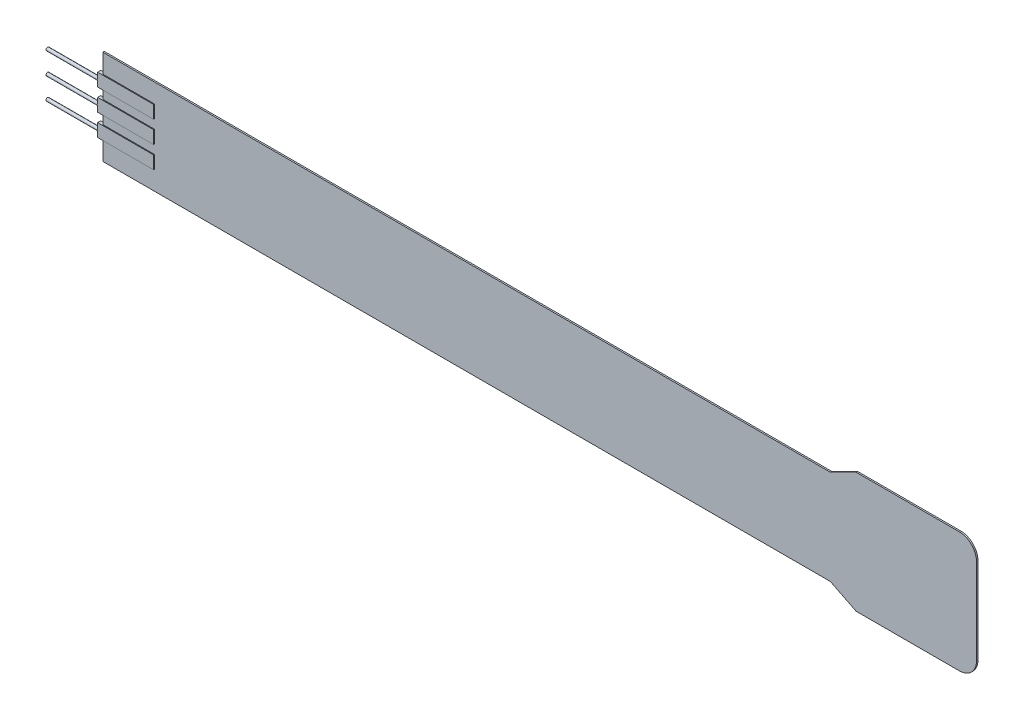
ISO-10303-21;
HEADER;
FILE_DESCRIPTION(('STEP AP214'),'2;1');
FILE_NAME('part.step','',(''),(''),'','','');
FILE_SCHEMA(('AUTOMOTIVE_DESIGN { 1 0 10303 214 1 1 1 1 }'));
ENDSEC;
DATA;
#1=APPLICATION_CONTEXT('core data for automotive mechanical design processes');
#2=APPLICATION_PROTOCOL_DEFINITION('international standard','automotive_design',2000,#1);
#3=PRODUCT_CONTEXT('',#1,'mechanical');
#4=PRODUCT('Part','Part','',(#3));
#5=PRODUCT_RELATED_PRODUCT_CATEGORY('part','',(#4));
#6=PRODUCT_DEFINITION_FORMATION('','',#4);
#7=PRODUCT_DEFINITION_CONTEXT('part definition',#1,'design');
#8=PRODUCT_DEFINITION('design','',#6,#7);
#9=PRODUCT_DEFINITION_SHAPE('','',#8);
#10=(LENGTH_UNIT() NAMED_UNIT(*) SI_UNIT(.MILLI.,.METRE.));
#11=(NAMED_UNIT(*) PLANE_ANGLE_UNIT() SI_UNIT($,.RADIAN.));
#12=(NAMED_UNIT(*) SI_UNIT($,.STERADIAN.) SOLID_ANGLE_UNIT());
#13=UNCERTAINTY_MEASURE_WITH_UNIT(LENGTH_MEASURE(1.E-05),#10,'distance_accuracy_value','');
#14=(GEOMETRIC_REPRESENTATION_CONTEXT(3) GLOBAL_UNCERTAINTY_ASSIGNED_CONTEXT((#13)) GLOBAL_UNIT_ASSIGNED_CONTEXT((#10,
#11,#12)) REPRESENTATION_CONTEXT('',''));
#15=CARTESIAN_POINT('',(0.,0.,0.));
#16=DIRECTION('',(0.,0.,1.));
#17=DIRECTION('',(1.,0.,0.));
#18=AXIS2_PLACEMENT_3D('',#15,#16,#17);
#19=CARTESIAN_POINT('',(7.,13.9999999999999,0.27));
#20=DIRECTION('',(0.,0.,-1.));
#21=DIRECTION('',(-1.,0.,0.));
#22=AXIS2_PLACEMENT_3D('',#19,#20,#21);
#23=PLANE('',#22);
#24=DIRECTION('',(1.,0.,0.));
#25=VECTOR('',#24,1.);
#26=CARTESIAN_POINT('',(-88.6,3.29,0.27));
#27=LINE('',#26,#25);
#28=CARTESIAN_POINT('',(-88.6,3.29,0.27));
#29=VERTEX_POINT('',#28);
#30=CARTESIAN_POINT('',(-95.1,3.29,0.27));
#31=VERTEX_POINT('',#30);
#32=EDGE_CURVE('P0_E79',#29,#31,#27,.F.);
#33=ORIENTED_EDGE('',*,*,#32,.T.);
#34=DIRECTION('',(0.,1.,0.));
#35=VECTOR('',#34,1.);
#36=CARTESIAN_POINT('',(-95.1,3.29,0.27));
#37=LINE('',#36,#35);
#38=CARTESIAN_POINT('',(-95.1,1.79,0.27));
#39=VERTEX_POINT('',#38);
#40=EDGE_CURVE('P0_E54',#31,#39,#37,.F.);
#41=ORIENTED_EDGE('',*,*,#40,.T.);
#42=DIRECTION('',(1.,0.,0.));
#43=VECTOR('',#42,1.);
#44=CARTESIAN_POINT('',(-88.6,1.79,0.27));
#45=LINE('',#44,#43);
#46=CARTESIAN_POINT('',(-88.6,1.79,0.27));
#47=VERTEX_POINT('',#46);
#48=EDGE_CURVE('P0_E56',#39,#47,#45,.T.);
#49=ORIENTED_EDGE('',*,*,#48,.T.);
#50=DIRECTION('',(0.,1.,0.));
#51=VECTOR('',#50,1.);
#52=CARTESIAN_POINT('',(-88.6,3.29,0.27));
#53=LINE('',#52,#51);
#54=EDGE_CURVE('P0_E19',#47,#29,#53,.T.);
#55=ORIENTED_EDGE('',*,*,#54,.T.);
#56=EDGE_LOOP('',(#33,#41,#49,#55));
#57=FACE_BOUND('',#56,.T.);
#58=ADVANCED_FACE('P0_F16',(#57),#23,.F.);
#59=CARTESIAN_POINT('',(-88.6,3.29,-0.1));
#60=DIRECTION('',(-1.,0.,0.));
#61=DIRECTION('',(0.,0.,1.));
#62=AXIS2_PLACEMENT_3D('',#59,#60,#61);
#63=PLANE('',#62);
#64=ORIENTED_EDGE('',*,*,#54,.F.);
#65=DIRECTION('',(0.,0.,1.));
#66=VECTOR('',#65,1.);
#67=CARTESIAN_POINT('',(-88.6,1.79,-0.1));
#68=LINE('',#67,#66);
#69=CARTESIAN_POINT('',(-88.6,1.79,-0.1));
#70=VERTEX_POINT('',#69);
#71=EDGE_CURVE('P0_E62',#47,#70,#68,.F.);
#72=ORIENTED_EDGE('',*,*,#71,.T.);
#73=DIRECTION('',(0.,1.,0.));
#74=VECTOR('',#73,1.);
#75=CARTESIAN_POINT('',(-88.6,1.79,-0.1));
#76=LINE('',#75,#74);
#77=CARTESIAN_POINT('',(-88.6,3.29,-0.1));
#78=VERTEX_POINT('',#77);
#79=EDGE_CURVE('P0_E82',#78,#70,#76,.F.);
#80=ORIENTED_EDGE('',*,*,#79,.F.);
#81=DIRECTION('',(0.,0.,-1.));
#82=VECTOR('',#81,1.);
#83=CARTESIAN_POINT('',(-88.6,3.29,-0.1));
#84=LINE('',#83,#82);
#85=EDGE_CURVE('P0_E67',#78,#29,#84,.F.);
#86=ORIENTED_EDGE('',*,*,#85,.T.);
#87=EDGE_LOOP('',(#64,#72,#80,#86));
#88=FACE_BOUND('',#87,.T.);
#89=ADVANCED_FACE('P0_F64',(#88),#63,.F.);
#90=CARTESIAN_POINT('',(-88.6,1.79,-0.1));
#91=DIRECTION('',(0.,1.,0.));
#92=DIRECTION('',(0.,0.,1.));
#93=AXIS2_PLACEMENT_3D('',#90,#91,#92);
#94=PLANE('',#93);
#95=ORIENTED_EDGE('',*,*,#48,.F.);
#96=DIRECTION('',(0.,0.,-1.));
#97=VECTOR('',#96,1.);
#98=CARTESIAN_POINT('',(-95.1,1.79,-0.1));
#99=LINE('',#98,#97);
#100=CARTESIAN_POINT('',(-95.1,1.79,-0.1));
#101=VERTEX_POINT('',#100);
#102=EDGE_CURVE('P0_E74',#39,#101,#99,.T.);
#103=ORIENTED_EDGE('',*,*,#102,.T.);
#104=DIRECTION('',(-1.,0.,0.));
#105=VECTOR('',#104,1.);
#106=CARTESIAN_POINT('',(-88.6,1.79,-0.1));
#107=LINE('',#106,#105);
#108=EDGE_CURVE('P0_E71',#70,#101,#107,.T.);
#109=ORIENTED_EDGE('',*,*,#108,.F.);
#110=ORIENTED_EDGE('',*,*,#71,.F.);
#111=EDGE_LOOP('',(#95,#103,#109,#110));
#112=FACE_BOUND('',#111,.T.);
#113=ADVANCED_FACE('P0_F69',(#112),#94,.F.);
#114=CARTESIAN_POINT('',(-95.1,3.29,-0.1));
#115=DIRECTION('',(1.,0.,0.));
#116=DIRECTION('',(0.,0.,-1.));
#117=AXIS2_PLACEMENT_3D('',#114,#115,#116);
#118=PLANE('',#117);
#119=ORIENTED_EDGE('',*,*,#40,.F.);
#120=DIRECTION('',(0.,0.,-1.));
#121=VECTOR('',#120,1.);
#122=CARTESIAN_POINT('',(-95.1,3.29,-0.1));
#123=LINE('',#122,#121);
#124=CARTESIAN_POINT('',(-95.1,3.29,-0.1));
#125=VERTEX_POINT('',#124);
#126=EDGE_CURVE('P0_E34',#31,#125,#123,.T.);
#127=ORIENTED_EDGE('',*,*,#126,.T.);
#128=DIRECTION('',(0.,1.,0.));
#129=VECTOR('',#128,1.);
#130=CARTESIAN_POINT('',(-95.1,1.79,-0.1));
#131=LINE('',#130,#129);
#132=EDGE_CURVE('P0_E25',#101,#125,#131,.T.);
#133=ORIENTED_EDGE('',*,*,#132,.F.);
#134=ORIENTED_EDGE('',*,*,#102,.F.);
#135=EDGE_LOOP('',(#119,#127,#133,#134));
#136=FACE_BOUND('',#135,.T.);
#137=ADVANCED_FACE('P0_F88',(#136),#118,.F.);
#138=CARTESIAN_POINT('',(-88.6,3.29,-0.1));
#139=DIRECTION('',(0.,-1.,0.));
#140=DIRECTION('',(0.,0.,-1.));
#141=AXIS2_PLACEMENT_3D('',#138,#139,#140);
#142=PLANE('',#141);
#143=ORIENTED_EDGE('',*,*,#32,.F.);
#144=ORIENTED_EDGE('',*,*,#85,.F.);
#145=DIRECTION('',(-1.,0.,0.));
#146=VECTOR('',#145,1.);
#147=CARTESIAN_POINT('',(-88.6,3.29,-0.1));
#148=LINE('',#147,#146);
#149=EDGE_CURVE('P0_E11',#125,#78,#148,.F.);
#150=ORIENTED_EDGE('',*,*,#149,.F.);
#151=ORIENTED_EDGE('',*,*,#126,.F.);
#152=EDGE_LOOP('',(#143,#144,#150,#151));
#153=FACE_BOUND('',#152,.T.);
#154=ADVANCED_FACE('P0_F90',(#153),#142,.F.);
#155=CARTESIAN_POINT('',(-88.6,1.79,-0.1));
#156=DIRECTION('',(0.,0.,-1.));
#157=DIRECTION('',(-1.,0.,0.));
#158=AXIS2_PLACEMENT_3D('',#155,#156,#157);
#159=PLANE('',#158);
#160=ORIENTED_EDGE('',*,*,#132,.T.);
#161=ORIENTED_EDGE('',*,*,#149,.T.);
#162=ORIENTED_EDGE('',*,*,#79,.T.);
#163=ORIENTED_EDGE('',*,*,#108,.T.);
#164=EDGE_LOOP('',(#160,#161,#162,#163));
#165=FACE_BOUND('',#164,.T.);
#166=ADVANCED_FACE('P0_F87',(#165),#159,.T.);
#167=CLOSED_SHELL('',(#58,#89,#113,#137,#154,#166));
#168=MANIFOLD_SOLID_BREP('P0_B1',#167);
#169=CARTESIAN_POINT('',(7.,13.9999999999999,0.17));
#170=DIRECTION('',(0.,0.,-1.));
#171=DIRECTION('',(-1.,0.,0.));
#172=AXIS2_PLACEMENT_3D('',#169,#170,#171);
#173=PLANE('',#172);
#174=DIRECTION('',(1.,0.,0.));
#175=VECTOR('',#174,1.);
#176=CARTESIAN_POINT('',(-94.6,5.50000000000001,0.17));
#177=LINE('',#176,#175);
#178=CARTESIAN_POINT('',(-9.99999999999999,5.5,0.17));
#179=VERTEX_POINT('',#178);
#180=CARTESIAN_POINT('',(-94.6,5.50000000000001,0.17));
#181=VERTEX_POINT('',#180);
#182=EDGE_CURVE('P1_E110',#179,#181,#177,.F.);
#183=ORIENTED_EDGE('',*,*,#182,.T.);
#184=DIRECTION('',(0.,1.,0.));
#185=VECTOR('',#184,1.);
#186=CARTESIAN_POINT('',(-94.6,5.50000000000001,0.17));
#187=LINE('',#186,#185);
#188=CARTESIAN_POINT('',(-94.6,-5.50000000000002,0.17));
#189=VERTEX_POINT('',#188);
#190=EDGE_CURVE('P1_E142',#181,#189,#187,.F.);
#191=ORIENTED_EDGE('',*,*,#190,.T.);
#192=DIRECTION('',(-1.,0.,0.));
#193=VECTOR('',#192,1.);
#194=CARTESIAN_POINT('',(-94.6,-5.50000000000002,0.17));
#195=LINE('',#194,#193);
#196=CARTESIAN_POINT('',(-9.99999999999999,-5.50000000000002,0.17));
#197=VERTEX_POINT('',#196);
#198=EDGE_CURVE('P1_E75',#189,#197,#195,.F.);
#199=ORIENTED_EDGE('',*,*,#198,.T.);
#200=DIRECTION('',(-0.894427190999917,0.447213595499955,0.));
#201=VECTOR('',#200,1.);
#202=CARTESIAN_POINT('',(-9.99999999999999,-5.50000000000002,0.17));
#203=LINE('',#202,#201);
#204=CARTESIAN_POINT('',(-6.99999999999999,-7.00000000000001,0.17));
#205=VERTEX_POINT('',#204);
#206=EDGE_CURVE('P1_E71',#197,#205,#203,.F.);
#207=ORIENTED_EDGE('',*,*,#206,.T.);
#208=DIRECTION('',(1.,0.,0.));
#209=VECTOR('',#208,1.);
#210=CARTESIAN_POINT('',(7.00000000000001,-7.00000000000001,0.17));
#211=LINE('',#210,#209);
#212=CARTESIAN_POINT('',(5.00000000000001,-7.00000000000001,0.17));
#213=VERTEX_POINT('',#212);
#214=EDGE_CURVE('P1_E67',#205,#213,#211,.T.);
#215=ORIENTED_EDGE('',*,*,#214,.T.);
#216=CARTESIAN_POINT('',(5.00000000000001,-5.00000000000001,0.17));
#217=DIRECTION('',(0.,0.,-1.));
#218=DIRECTION('',(-1.,0.,0.));
#219=AXIS2_PLACEMENT_3D('',#216,#217,#218);
#220=CIRCLE('',#219,2.);
#221=CARTESIAN_POINT('',(7.00000000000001,-5.00000000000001,0.17));
#222=VERTEX_POINT('',#221);
#223=EDGE_CURVE('P1_E19',#222,#213,#220,.T.);
#224=ORIENTED_EDGE('',*,*,#223,.F.);
#225=DIRECTION('',(0.,-1.,0.));
#226=VECTOR('',#225,1.);
#227=CARTESIAN_POINT('',(7.,6.99999999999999,0.17));
#228=LINE('',#227,#226);
#229=CARTESIAN_POINT('',(7.,4.99999999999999,0.17));
#230=VERTEX_POINT('',#229);
#231=EDGE_CURVE('P1_E173',#222,#230,#228,.F.);
#232=ORIENTED_EDGE('',*,*,#231,.T.);
#233=CARTESIAN_POINT('',(5.,4.99999999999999,0.17));
#234=DIRECTION('',(0.,0.,-1.));
#235=DIRECTION('',(-1.,0.,0.));
#236=AXIS2_PLACEMENT_3D('',#233,#234,#235);
#237=CIRCLE('',#236,2.);
#238=CARTESIAN_POINT('',(5.,6.99999999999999,0.17));
#239=VERTEX_POINT('',#238);
#240=EDGE_CURVE('P1_E170',#239,#230,#237,.T.);
#241=ORIENTED_EDGE('',*,*,#240,.F.);
#242=DIRECTION('',(1.,0.,0.));
#243=VECTOR('',#242,1.);
#244=CARTESIAN_POINT('',(-7.,6.99999999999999,0.17));
#245=LINE('',#244,#243);
#246=CARTESIAN_POINT('',(-7.,6.99999999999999,0.17));
#247=VERTEX_POINT('',#246);
#248=EDGE_CURVE('P1_E167',#239,#247,#245,.F.);
#249=ORIENTED_EDGE('',*,*,#248,.T.);
#250=DIRECTION('',(0.894427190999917,0.447213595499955,0.));
#251=VECTOR('',#250,1.);
#252=CARTESIAN_POINT('',(-9.99999999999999,5.5,0.17));
#253=LINE('',#252,#251);
#254=EDGE_CURVE('P1_E113',#247,#179,#253,.F.);
#255=ORIENTED_EDGE('',*,*,#254,.T.);
#256=EDGE_LOOP('',(#183,#191,#199,#207,#215,#224,#232,#241,#249,#255));
#257=FACE_BOUND('',#256,.T.);
#258=ADVANCED_FACE('P1_F16',(#257),#173,.F.);
#259=CARTESIAN_POINT('',(7.,6.99999999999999,0.17));
#260=DIRECTION('',(-1.,0.,0.));
#261=DIRECTION('',(0.,-1.,0.));
#262=AXIS2_PLACEMENT_3D('',#259,#260,#261);
#263=PLANE('',#262);
#264=DIRECTION('',(0.,0.,-1.));
#265=VECTOR('',#264,1.);
#266=CARTESIAN_POINT('',(7.00000000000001,-5.00000000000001,0.17));
#267=LINE('',#266,#265);
#268=CARTESIAN_POINT('',(7.00000000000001,-5.00000000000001,0.));
#269=VERTEX_POINT('',#268);
#270=EDGE_CURVE('P1_E164',#269,#222,#267,.F.);
#271=ORIENTED_EDGE('',*,*,#270,.F.);
#272=DIRECTION('',(0.,1.,0.));
#273=VECTOR('',#272,1.);
#274=CARTESIAN_POINT('',(7.,13.9999999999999,0.));
#275=LINE('',#274,#273);
#276=CARTESIAN_POINT('',(7.,5.,0.));
#277=VERTEX_POINT('',#276);
#278=EDGE_CURVE('P1_E195',#277,#269,#275,.F.);
#279=ORIENTED_EDGE('',*,*,#278,.F.);
#280=DIRECTION('',(0.,0.,-1.));
#281=VECTOR('',#280,1.);
#282=CARTESIAN_POINT('',(7.,4.99999999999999,0.17));
#283=LINE('',#282,#281);
#284=EDGE_CURVE('P1_E197',#230,#277,#283,.T.);
#285=ORIENTED_EDGE('',*,*,#284,.F.);
#286=ORIENTED_EDGE('',*,*,#231,.F.);
#287=EDGE_LOOP('',(#271,#279,#285,#286));
#288=FACE_BOUND('',#287,.T.);
#289=ADVANCED_FACE('P1_F251',(#288),#263,.F.);
#290=CARTESIAN_POINT('',(5.00000000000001,-5.00000000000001,0.17));
#291=DIRECTION('',(0.,0.,-1.));
#292=DIRECTION('',(-1.,0.,0.));
#293=AXIS2_PLACEMENT_3D('',#290,#291,#292);
#294=CYLINDRICAL_SURFACE('',#293,2.);
#295=CARTESIAN_POINT('',(5.00000000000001,-5.00000000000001,0.));
#296=DIRECTION('',(0.,0.,-1.));
#297=DIRECTION('',(-1.,0.,0.));
#298=AXIS2_PLACEMENT_3D('',#295,#296,#297);
#299=CIRCLE('',#298,2.);
#300=CARTESIAN_POINT('',(5.00000000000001,-7.00000000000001,0.));
#301=VERTEX_POINT('',#300);
#302=EDGE_CURVE('P1_E193',#269,#301,#299,.T.);
#303=ORIENTED_EDGE('',*,*,#302,.F.);
#304=ORIENTED_EDGE('',*,*,#270,.T.);
#305=ORIENTED_EDGE('',*,*,#223,.T.);
#306=DIRECTION('',(0.,0.,1.));
#307=VECTOR('',#306,1.);
#308=CARTESIAN_POINT('',(5.00000000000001,-7.00000000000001,0.17));
#309=LINE('',#308,#307);
#310=EDGE_CURVE('P1_E162',#213,#301,#309,.F.);
#311=ORIENTED_EDGE('',*,*,#310,.T.);
#312=EDGE_LOOP('',(#303,#304,#305,#311));
#313=FACE_BOUND('',#312,.T.);
#314=ADVANCED_FACE('P1_F248',(#313),#294,.T.);
#315=CARTESIAN_POINT('',(7.00000000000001,-7.00000000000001,0.17));
#316=DIRECTION('',(0.,1.,0.));
#317=DIRECTION('',(0.,0.,1.));
#318=AXIS2_PLACEMENT_3D('',#315,#316,#317);
#319=PLANE('',#318);
#320=ORIENTED_EDGE('',*,*,#310,.F.);
#321=ORIENTED_EDGE('',*,*,#214,.F.);
#322=DIRECTION('',(0.,0.,1.));
#323=VECTOR('',#322,1.);
#324=CARTESIAN_POINT('',(-6.99999999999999,-7.00000000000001,0.17));
#325=LINE('',#324,#323);
#326=CARTESIAN_POINT('',(-6.99999999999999,-7.00000000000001,0.));
#327=VERTEX_POINT('',#326);
#328=EDGE_CURVE('P1_E158',#205,#327,#325,.F.);
#329=ORIENTED_EDGE('',*,*,#328,.T.);
#330=DIRECTION('',(-1.,0.,0.));
#331=VECTOR('',#330,1.);
#332=CARTESIAN_POINT('',(7.,-7.00000000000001,0.));
#333=LINE('',#332,#331);
#334=EDGE_CURVE('P1_E155',#301,#327,#333,.T.);
#335=ORIENTED_EDGE('',*,*,#334,.F.);
#336=EDGE_LOOP('',(#320,#321,#329,#335));
#337=FACE_BOUND('',#336,.T.);
#338=ADVANCED_FACE('P1_F244',(#337),#319,.F.);
#339=CARTESIAN_POINT('',(-9.99999999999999,-5.50000000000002,0.17));
#340=DIRECTION('',(0.447213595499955,0.894427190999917,0.));
#341=DIRECTION('',(-0.894427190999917,0.447213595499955,0.));
#342=AXIS2_PLACEMENT_3D('',#339,#340,#341);
#343=PLANE('',#342);
#344=ORIENTED_EDGE('',*,*,#328,.F.);
#345=ORIENTED_EDGE('',*,*,#206,.F.);
#346=DIRECTION('',(0.,0.,1.));
#347=VECTOR('',#346,1.);
#348=CARTESIAN_POINT('',(-9.99999999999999,-5.50000000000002,0.17));
#349=LINE('',#348,#347);
#350=CARTESIAN_POINT('',(-10.,-5.50000000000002,0.));
#351=VERTEX_POINT('',#350);
#352=EDGE_CURVE('P1_E149',#197,#351,#349,.F.);
#353=ORIENTED_EDGE('',*,*,#352,.T.);
#354=DIRECTION('',(-0.894427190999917,0.447213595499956,0.));
#355=VECTOR('',#354,1.);
#356=CARTESIAN_POINT('',(-6.99999999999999,-7.00000000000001,0.));
#357=LINE('',#356,#355);
#358=EDGE_CURVE('P1_E146',#327,#351,#357,.T.);
#359=ORIENTED_EDGE('',*,*,#358,.F.);
#360=EDGE_LOOP('',(#344,#345,#353,#359));
#361=FACE_BOUND('',#360,.T.);
#362=ADVANCED_FACE('P1_F240',(#361),#343,.F.);
#363=CARTESIAN_POINT('',(-94.6,-5.50000000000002,0.17));
#364=DIRECTION('',(0.,1.,0.));
#365=DIRECTION('',(-1.,0.,0.));
#366=AXIS2_PLACEMENT_3D('',#363,#364,#365);
#367=PLANE('',#366);
#368=ORIENTED_EDGE('',*,*,#352,.F.);
#369=ORIENTED_EDGE('',*,*,#198,.F.);
#370=DIRECTION('',(0.,0.,-1.));
#371=VECTOR('',#370,1.);
#372=CARTESIAN_POINT('',(-94.6,-5.50000000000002,0.17));
#373=LINE('',#372,#371);
#374=CARTESIAN_POINT('',(-94.6,-5.50000000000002,0.));
#375=VERTEX_POINT('',#374);
#376=EDGE_CURVE('P1_E140',#189,#375,#373,.T.);
#377=ORIENTED_EDGE('',*,*,#376,.T.);
#378=DIRECTION('',(-1.,0.,0.));
#379=VECTOR('',#378,1.);
#380=CARTESIAN_POINT('',(7.,-5.50000000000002,0.));
#381=LINE('',#380,#379);
#382=EDGE_CURVE('P1_E127',#351,#375,#381,.T.);
#383=ORIENTED_EDGE('',*,*,#382,.F.);
#384=EDGE_LOOP('',(#368,#369,#377,#383));
#385=FACE_BOUND('',#384,.T.);
#386=ADVANCED_FACE('P1_F236',(#385),#367,.F.);
#387=CARTESIAN_POINT('',(-94.6,5.50000000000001,0.17));
#388=DIRECTION('',(1.,0.,0.));
#389=DIRECTION('',(0.,0.,-1.));
#390=AXIS2_PLACEMENT_3D('',#387,#388,#389);
#391=PLANE('',#390);
#392=ORIENTED_EDGE('',*,*,#376,.F.);
#393=ORIENTED_EDGE('',*,*,#190,.F.);
#394=DIRECTION('',(0.,0.,1.));
#395=VECTOR('',#394,1.);
#396=CARTESIAN_POINT('',(-94.6,5.50000000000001,0.17));
#397=LINE('',#396,#395);
#398=CARTESIAN_POINT('',(-94.6,5.50000000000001,0.));
#399=VERTEX_POINT('',#398);
#400=EDGE_CURVE('P1_E134',#181,#399,#397,.F.);
#401=ORIENTED_EDGE('',*,*,#400,.T.);
#402=DIRECTION('',(0.,1.,0.));
#403=VECTOR('',#402,1.);
#404=CARTESIAN_POINT('',(-94.6,13.9999999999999,0.));
#405=LINE('',#404,#403);
#406=EDGE_CURVE('P1_E125',#375,#399,#405,.T.);
#407=ORIENTED_EDGE('',*,*,#406,.F.);
#408=EDGE_LOOP('',(#392,#393,#401,#407));
#409=FACE_BOUND('',#408,.T.);
#410=ADVANCED_FACE('P1_F233',(#409),#391,.F.);
#411=CARTESIAN_POINT('',(-94.6,5.50000000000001,0.17));
#412=DIRECTION('',(0.,-1.,0.));
#413=DIRECTION('',(1.,0.,0.));
#414=AXIS2_PLACEMENT_3D('',#411,#412,#413);
#415=PLANE('',#414);
#416=ORIENTED_EDGE('',*,*,#400,.F.);
#417=ORIENTED_EDGE('',*,*,#182,.F.);
#418=DIRECTION('',(0.,0.,1.));
#419=VECTOR('',#418,1.);
#420=CARTESIAN_POINT('',(-9.99999999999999,5.5,0.17));
#421=LINE('',#420,#419);
#422=CARTESIAN_POINT('',(-10.,5.5,0.));
#423=VERTEX_POINT('',#422);
#424=EDGE_CURVE('P1_E102',#179,#423,#421,.F.);
#425=ORIENTED_EDGE('',*,*,#424,.T.);
#426=DIRECTION('',(-1.,0.,0.));
#427=VECTOR('',#426,1.);
#428=CARTESIAN_POINT('',(7.,5.50000000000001,0.));
#429=LINE('',#428,#427);
#430=EDGE_CURVE('P1_E107',#399,#423,#429,.F.);
#431=ORIENTED_EDGE('',*,*,#430,.F.);
#432=EDGE_LOOP('',(#416,#417,#425,#431));
#433=FACE_BOUND('',#432,.T.);
#434=ADVANCED_FACE('P1_F105',(#433),#415,.F.);
#435=CARTESIAN_POINT('',(-9.99999999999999,5.5,0.17));
#436=DIRECTION('',(0.447213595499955,-0.894427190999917,0.));
#437=DIRECTION('',(0.894427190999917,0.447213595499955,0.));
#438=AXIS2_PLACEMENT_3D('',#435,#436,#437);
#439=PLANE('',#438);
#440=ORIENTED_EDGE('',*,*,#424,.F.);
#441=ORIENTED_EDGE('',*,*,#254,.F.);
#442=DIRECTION('',(0.,0.,1.));
#443=VECTOR('',#442,1.);
#444=CARTESIAN_POINT('',(-7.,6.99999999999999,0.17));
#445=LINE('',#444,#443);
#446=CARTESIAN_POINT('',(-7.,6.99999999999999,0.));
#447=VERTEX_POINT('',#446);
#448=EDGE_CURVE('P1_E112',#247,#447,#445,.F.);
#449=ORIENTED_EDGE('',*,*,#448,.T.);
#450=DIRECTION('',(0.894427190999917,0.447213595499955,0.));
#451=VECTOR('',#450,1.);
#452=CARTESIAN_POINT('',(-9.99999999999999,5.5,0.));
#453=LINE('',#452,#451);
#454=EDGE_CURVE('P1_E116',#423,#447,#453,.T.);
#455=ORIENTED_EDGE('',*,*,#454,.F.);
#456=EDGE_LOOP('',(#440,#441,#449,#455));
#457=FACE_BOUND('',#456,.T.);
#458=ADVANCED_FACE('P1_F117',(#457),#439,.F.);
#459=CARTESIAN_POINT('',(-7.,6.99999999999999,0.17));
#460=DIRECTION('',(0.,-1.,0.));
#461=DIRECTION('',(1.,0.,0.));
#462=AXIS2_PLACEMENT_3D('',#459,#460,#461);
#463=PLANE('',#462);
#464=DIRECTION('',(0.,0.,-1.));
#465=VECTOR('',#464,1.);
#466=CARTESIAN_POINT('',(5.,6.99999999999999,0.17));
#467=LINE('',#466,#465);
#468=CARTESIAN_POINT('',(5.,6.99999999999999,0.));
#469=VERTEX_POINT('',#468);
#470=EDGE_CURVE('P1_E34',#469,#239,#467,.F.);
#471=ORIENTED_EDGE('',*,*,#470,.F.);
#472=DIRECTION('',(-1.,0.,0.));
#473=VECTOR('',#472,1.);
#474=CARTESIAN_POINT('',(7.,6.99999999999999,0.));
#475=LINE('',#474,#473);
#476=EDGE_CURVE('P1_E25',#447,#469,#475,.F.);
#477=ORIENTED_EDGE('',*,*,#476,.F.);
#478=ORIENTED_EDGE('',*,*,#448,.F.);
#479=ORIENTED_EDGE('',*,*,#248,.F.);
#480=EDGE_LOOP('',(#471,#477,#478,#479));
#481=FACE_BOUND('',#480,.T.);
#482=ADVANCED_FACE('P1_F217',(#481),#463,.F.);
#483=CARTESIAN_POINT('',(5.,4.99999999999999,0.17));
#484=DIRECTION('',(0.,0.,-1.));
#485=DIRECTION('',(-1.,0.,0.));
#486=AXIS2_PLACEMENT_3D('',#483,#484,#485);
#487=CYLINDRICAL_SURFACE('',#486,2.);
#488=CARTESIAN_POINT('',(5.,4.99999999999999,0.));
#489=DIRECTION('',(0.,0.,-1.));
#490=DIRECTION('',(-1.,0.,0.));
#491=AXIS2_PLACEMENT_3D('',#488,#489,#490);
#492=CIRCLE('',#491,2.);
#493=EDGE_CURVE('P1_E11',#469,#277,#492,.T.);
#494=ORIENTED_EDGE('',*,*,#493,.F.);
#495=ORIENTED_EDGE('',*,*,#470,.T.);
#496=ORIENTED_EDGE('',*,*,#240,.T.);
#497=ORIENTED_EDGE('',*,*,#284,.T.);
#498=EDGE_LOOP('',(#494,#495,#496,#497));
#499=FACE_BOUND('',#498,.T.);
#500=ADVANCED_FACE('P1_F218',(#499),#487,.T.);
#501=CARTESIAN_POINT('',(7.,13.9999999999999,0.));
#502=DIRECTION('',(0.,0.,-1.));
#503=DIRECTION('',(-1.,0.,0.));
#504=AXIS2_PLACEMENT_3D('',#501,#502,#503);
#505=PLANE('',#504);
#506=ORIENTED_EDGE('',*,*,#476,.T.);
#507=ORIENTED_EDGE('',*,*,#493,.T.);
#508=ORIENTED_EDGE('',*,*,#278,.T.);
#509=ORIENTED_EDGE('',*,*,#302,.T.);
#510=ORIENTED_EDGE('',*,*,#334,.T.);
#511=ORIENTED_EDGE('',*,*,#358,.T.);
#512=ORIENTED_EDGE('',*,*,#382,.T.);
#513=ORIENTED_EDGE('',*,*,#406,.T.);
#514=ORIENTED_EDGE('',*,*,#430,.T.);
#515=ORIENTED_EDGE('',*,*,#454,.T.);
#516=EDGE_LOOP('',(#506,#507,#508,#509,#510,#511,#512,#513,#514,#515));
#517=FACE_BOUND('',#516,.T.);
#518=ADVANCED_FACE('P1_F122',(#517),#505,.T.);
#519=CLOSED_SHELL('',(#258,#289,#314,#338,#362,#386,#410,#434,#458,#482,#500,#518));
#520=MANIFOLD_SOLID_BREP('P1_B1',#519);
#521=CARTESIAN_POINT('',(-101.1,-2.54,0.0850000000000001));
#522=DIRECTION('',(-1.,0.,0.));
#523=DIRECTION('',(0.,0.,1.));
#524=AXIS2_PLACEMENT_3D('',#521,#522,#523);
#525=PLANE('',#524);
#526=CARTESIAN_POINT('',(-101.1,-2.54,0.0850000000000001));
#527=DIRECTION('',(1.,0.,0.));
#528=DIRECTION('',(0.,0.,-1.));
#529=AXIS2_PLACEMENT_3D('',#526,#527,#528);
#530=CIRCLE('',#529,0.185);
#531=CARTESIAN_POINT('',(-101.1,-2.54,-0.1));
#532=VERTEX_POINT('',#531);
#533=EDGE_CURVE('P2_E19',#532,#532,#530,.T.);
#534=ORIENTED_EDGE('',*,*,#533,.F.);
#535=EDGE_LOOP('',(#534));
#536=FACE_BOUND('',#535,.T.);
#537=ADVANCED_FACE('P2_F16',(#536),#525,.T.);
#538=CARTESIAN_POINT('',(-101.1,-2.54,0.0850000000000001));
#539=DIRECTION('',(1.,0.,0.));
#540=DIRECTION('',(0.,0.,-1.));
#541=AXIS2_PLACEMENT_3D('',#538,#539,#540);
#542=CYLINDRICAL_SURFACE('',#541,0.185);
#543=CARTESIAN_POINT('',(-95.1,-2.54,0.0850000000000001));
#544=DIRECTION('',(1.,0.,0.));
#545=DIRECTION('',(0.,0.,-1.));
#546=AXIS2_PLACEMENT_3D('',#543,#544,#545);
#547=CIRCLE('',#546,0.185);
#548=CARTESIAN_POINT('',(-95.1,-2.54,-0.1));
#549=VERTEX_POINT('',#548);
#550=CARTESIAN_POINT('',(-95.1,-2.54,0.27));
#551=VERTEX_POINT('',#550);
#552=EDGE_CURVE('P2_E65',#549,#551,#547,.F.);
#553=ORIENTED_EDGE('',*,*,#552,.T.);
#554=CARTESIAN_POINT('',(-95.1,-2.54,0.0850000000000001));
#555=DIRECTION('',(1.,0.,0.));
#556=DIRECTION('',(0.,0.,-1.));
#557=AXIS2_PLACEMENT_3D('',#554,#555,#556);
#558=CIRCLE('',#557,0.185);
#559=EDGE_CURVE('P2_E69',#551,#549,#558,.F.);
#560=ORIENTED_EDGE('',*,*,#559,.T.);
#561=EDGE_LOOP('',(#553,#560));
#562=FACE_BOUND('',#561,.T.);
#563=ORIENTED_EDGE('',*,*,#533,.T.);
#564=EDGE_LOOP('',(#563));
#565=FACE_BOUND('',#564,.T.);
#566=ADVANCED_FACE('P2_F67',(#562,#565),#542,.T.);
#567=CARTESIAN_POINT('',(7.,13.9999999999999,0.27));
#568=DIRECTION('',(0.,0.,-1.));
#569=DIRECTION('',(-1.,0.,0.));
#570=AXIS2_PLACEMENT_3D('',#567,#568,#569);
#571=PLANE('',#570);
#572=DIRECTION('',(1.,0.,0.));
#573=VECTOR('',#572,1.);
#574=CARTESIAN_POINT('',(-88.6,-1.79,0.27));
#575=LINE('',#574,#573);
#576=CARTESIAN_POINT('',(-88.6,-1.79,0.27));
#577=VERTEX_POINT('',#576);
#578=CARTESIAN_POINT('',(-95.1,-1.79,0.27));
#579=VERTEX_POINT('',#578);
#580=EDGE_CURVE('P2_E84',#577,#579,#575,.F.);
#581=ORIENTED_EDGE('',*,*,#580,.T.);
#582=DIRECTION('',(0.,1.,0.));
#583=VECTOR('',#582,1.);
#584=CARTESIAN_POINT('',(-95.1,-1.79,0.27));
#585=LINE('',#584,#583);
#586=EDGE_CURVE('P2_E73',#579,#551,#585,.F.);
#587=ORIENTED_EDGE('',*,*,#586,.T.);
#588=DIRECTION('',(0.,1.,0.));
#589=VECTOR('',#588,1.);
#590=CARTESIAN_POINT('',(-95.1,-1.79,0.270000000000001));
#591=LINE('',#590,#589);
#592=CARTESIAN_POINT('',(-95.1,-3.29,0.27));
#593=VERTEX_POINT('',#592);
#594=EDGE_CURVE('P2_E82',#551,#593,#591,.F.);
#595=ORIENTED_EDGE('',*,*,#594,.T.);
#596=DIRECTION('',(1.,0.,0.));
#597=VECTOR('',#596,1.);
#598=CARTESIAN_POINT('',(-88.6,-3.29,0.27));
#599=LINE('',#598,#597);
#600=CARTESIAN_POINT('',(-88.6,-3.29,0.27));
#601=VERTEX_POINT('',#600);
#602=EDGE_CURVE('P2_E60',#593,#601,#599,.T.);
#603=ORIENTED_EDGE('',*,*,#602,.T.);
#604=DIRECTION('',(0.,1.,0.));
#605=VECTOR('',#604,1.);
#606=CARTESIAN_POINT('',(-88.6,-1.79,0.27));
#607=LINE('',#606,#605);
#608=EDGE_CURVE('P2_E120',#601,#577,#607,.T.);
#609=ORIENTED_EDGE('',*,*,#608,.T.);
#610=EDGE_LOOP('',(#581,#587,#595,#603,#609));
#611=FACE_BOUND('',#610,.T.);
#612=ADVANCED_FACE('P2_F81',(#611),#571,.F.);
#613=CARTESIAN_POINT('',(-88.6,-1.79,-0.1));
#614=DIRECTION('',(-1.,0.,0.));
#615=DIRECTION('',(0.,0.,1.));
#616=AXIS2_PLACEMENT_3D('',#613,#614,#615);
#617=PLANE('',#616);
#618=ORIENTED_EDGE('',*,*,#608,.F.);
#619=DIRECTION('',(0.,0.,1.));
#620=VECTOR('',#619,1.);
#621=CARTESIAN_POINT('',(-88.6,-3.29,-0.1));
#622=LINE('',#621,#620);
#623=CARTESIAN_POINT('',(-88.6,-3.29,-0.1));
#624=VERTEX_POINT('',#623);
#625=EDGE_CURVE('P2_E88',#601,#624,#622,.F.);
#626=ORIENTED_EDGE('',*,*,#625,.T.);
#627=DIRECTION('',(0.,1.,0.));
#628=VECTOR('',#627,1.);
#629=CARTESIAN_POINT('',(-88.6,-3.29,-0.1));
#630=LINE('',#629,#628);
#631=CARTESIAN_POINT('',(-88.6,-1.79,-0.1));
#632=VERTEX_POINT('',#631);
#633=EDGE_CURVE('P2_E104',#632,#624,#630,.F.);
#634=ORIENTED_EDGE('',*,*,#633,.F.);
#635=DIRECTION('',(0.,0.,-1.));
#636=VECTOR('',#635,1.);
#637=CARTESIAN_POINT('',(-88.6,-1.79,-0.1));
#638=LINE('',#637,#636);
#639=EDGE_CURVE('P2_E79',#632,#577,#638,.F.);
#640=ORIENTED_EDGE('',*,*,#639,.T.);
#641=EDGE_LOOP('',(#618,#626,#634,#640));
#642=FACE_BOUND('',#641,.T.);
#643=ADVANCED_FACE('P2_F152',(#642),#617,.F.);
#644=CARTESIAN_POINT('',(-88.6,-3.29,-0.1));
#645=DIRECTION('',(0.,1.,0.));
#646=DIRECTION('',(0.,0.,1.));
#647=AXIS2_PLACEMENT_3D('',#644,#645,#646);
#648=PLANE('',#647);
#649=ORIENTED_EDGE('',*,*,#602,.F.);
#650=DIRECTION('',(0.,0.,-1.));
#651=VECTOR('',#650,1.);
#652=CARTESIAN_POINT('',(-95.1,-3.29,-0.1));
#653=LINE('',#652,#651);
#654=CARTESIAN_POINT('',(-95.1,-3.29,-0.1));
#655=VERTEX_POINT('',#654);
#656=EDGE_CURVE('P2_E74',#593,#655,#653,.T.);
#657=ORIENTED_EDGE('',*,*,#656,.T.);
#658=DIRECTION('',(-1.,0.,0.));
#659=VECTOR('',#658,1.);
#660=CARTESIAN_POINT('',(-88.6,-3.29,-0.1));
#661=LINE('',#660,#659);
#662=EDGE_CURVE('P2_E100',#624,#655,#661,.T.);
#663=ORIENTED_EDGE('',*,*,#662,.F.);
#664=ORIENTED_EDGE('',*,*,#625,.F.);
#665=EDGE_LOOP('',(#649,#657,#663,#664));
#666=FACE_BOUND('',#665,.T.);
#667=ADVANCED_FACE('P2_F149',(#666),#648,.F.);
#668=CARTESIAN_POINT('',(-95.1,-1.79,-0.1));
#669=DIRECTION('',(1.,0.,0.));
#670=DIRECTION('',(0.,0.,-1.));
#671=AXIS2_PLACEMENT_3D('',#668,#669,#670);
#672=PLANE('',#671);
#673=DIRECTION('',(0.,1.,0.));
#674=VECTOR('',#673,1.);
#675=CARTESIAN_POINT('',(-95.1,-3.29,-0.1));
#676=LINE('',#675,#674);
#677=EDGE_CURVE('P2_E103',#655,#549,#676,.T.);
#678=ORIENTED_EDGE('',*,*,#677,.F.);
#679=ORIENTED_EDGE('',*,*,#656,.F.);
#680=ORIENTED_EDGE('',*,*,#594,.F.);
#681=ORIENTED_EDGE('',*,*,#552,.F.);
#682=EDGE_LOOP('',(#678,#679,#680,#681));
#683=FACE_BOUND('',#682,.T.);
#684=ADVANCED_FACE('P2_F87',(#683),#672,.F.);
#685=CARTESIAN_POINT('',(-95.1,-1.79,-0.1));
#686=DIRECTION('',(1.,0.,0.));
#687=DIRECTION('',(0.,0.,-1.));
#688=AXIS2_PLACEMENT_3D('',#685,#686,#687);
#689=PLANE('',#688);
#690=ORIENTED_EDGE('',*,*,#586,.F.);
#691=DIRECTION('',(0.,0.,-1.));
#692=VECTOR('',#691,1.);
#693=CARTESIAN_POINT('',(-95.1,-1.79,-0.1));
#694=LINE('',#693,#692);
#695=CARTESIAN_POINT('',(-95.1,-1.79,-0.1));
#696=VERTEX_POINT('',#695);
#697=EDGE_CURVE('P2_E34',#579,#696,#694,.T.);
#698=ORIENTED_EDGE('',*,*,#697,.T.);
#699=DIRECTION('',(0.,1.,0.));
#700=VECTOR('',#699,1.);
#701=CARTESIAN_POINT('',(-95.1,-3.29,-0.1));
#702=LINE('',#701,#700);
#703=EDGE_CURVE('P2_E25',#549,#696,#702,.T.);
#704=ORIENTED_EDGE('',*,*,#703,.F.);
#705=ORIENTED_EDGE('',*,*,#559,.F.);
#706=EDGE_LOOP('',(#690,#698,#704,#705));
#707=FACE_BOUND('',#706,.T.);
#708=ADVANCED_FACE('P2_F76',(#707),#689,.F.);
#709=CARTESIAN_POINT('',(-88.6,-1.79,-0.1));
#710=DIRECTION('',(0.,-1.,0.));
#711=DIRECTION('',(0.,0.,-1.));
#712=AXIS2_PLACEMENT_3D('',#709,#710,#711);
#713=PLANE('',#712);
#714=ORIENTED_EDGE('',*,*,#580,.F.);
#715=ORIENTED_EDGE('',*,*,#639,.F.);
#716=DIRECTION('',(-1.,0.,0.));
#717=VECTOR('',#716,1.);
#718=CARTESIAN_POINT('',(-88.6,-1.79,-0.1));
#719=LINE('',#718,#717);
#720=EDGE_CURVE('P2_E11',#696,#632,#719,.F.);
#721=ORIENTED_EDGE('',*,*,#720,.F.);
#722=ORIENTED_EDGE('',*,*,#697,.F.);
#723=EDGE_LOOP('',(#714,#715,#721,#722));
#724=FACE_BOUND('',#723,.T.);
#725=ADVANCED_FACE('P2_F136',(#724),#713,.F.);
#726=CARTESIAN_POINT('',(-88.6,-3.29,-0.1));
#727=DIRECTION('',(0.,0.,-1.));
#728=DIRECTION('',(-1.,0.,0.));
#729=AXIS2_PLACEMENT_3D('',#726,#727,#728);
#730=PLANE('',#729);
#731=ORIENTED_EDGE('',*,*,#703,.T.);
#732=ORIENTED_EDGE('',*,*,#720,.T.);
#733=ORIENTED_EDGE('',*,*,#633,.T.);
#734=ORIENTED_EDGE('',*,*,#662,.T.);
#735=ORIENTED_EDGE('',*,*,#677,.T.);
#736=EDGE_LOOP('',(#731,#732,#733,#734,#735));
#737=FACE_BOUND('',#736,.T.);
#738=ADVANCED_FACE('P2_F134',(#737),#730,.T.);
#739=CLOSED_SHELL('',(#537,#566,#612,#643,#667,#684,#708,#725,#738));
#740=MANIFOLD_SOLID_BREP('P2_B1',#739);
#741=CARTESIAN_POINT('',(-88.6,-0.75,-0.1));
#742=DIRECTION('',(0.,0.,-1.));
#743=DIRECTION('',(-1.,0.,0.));
#744=AXIS2_PLACEMENT_3D('',#741,#742,#743);
#745=PLANE('',#744);
#746=DIRECTION('',(0.,1.,0.));
#747=VECTOR('',#746,1.);
#748=CARTESIAN_POINT('',(-95.1,0.75,-0.1));
#749=LINE('',#748,#747);
#750=CARTESIAN_POINT('',(-95.1,-0.75,-0.1));
#751=VERTEX_POINT('',#750);
#752=CARTESIAN_POINT('',(-95.1,0.75,-0.1));
#753=VERTEX_POINT('',#752);
#754=EDGE_CURVE('P3_E57',#751,#753,#749,.T.);
#755=ORIENTED_EDGE('',*,*,#754,.T.);
#756=DIRECTION('',(1.,0.,0.));
#757=VECTOR('',#756,1.);
#758=CARTESIAN_POINT('',(-88.6,0.75,-0.1));
#759=LINE('',#758,#757);
#760=CARTESIAN_POINT('',(-88.6,0.75,-0.1));
#761=VERTEX_POINT('',#760);
#762=EDGE_CURVE('P3_E52',#753,#761,#759,.T.);
#763=ORIENTED_EDGE('',*,*,#762,.T.);
#764=DIRECTION('',(0.,1.,0.));
#765=VECTOR('',#764,1.);
#766=CARTESIAN_POINT('',(-88.6,-0.75,-0.1));
#767=LINE('',#766,#765);
#768=CARTESIAN_POINT('',(-88.6,-0.75,-0.1));
#769=VERTEX_POINT('',#768);
#770=EDGE_CURVE('P3_E19',#761,#769,#767,.F.);
#771=ORIENTED_EDGE('',*,*,#770,.T.);
#772=DIRECTION('',(1.,0.,0.));
#773=VECTOR('',#772,1.);
#774=CARTESIAN_POINT('',(-88.6,-0.75,-0.1));
#775=LINE('',#774,#773);
#776=EDGE_CURVE('P3_E66',#769,#751,#775,.F.);
#777=ORIENTED_EDGE('',*,*,#776,.T.);
#778=EDGE_LOOP('',(#755,#763,#771,#777));
#779=FACE_BOUND('',#778,.T.);
#780=ADVANCED_FACE('P3_F16',(#779),#745,.T.);
#781=CARTESIAN_POINT('',(-88.6,-0.75,-0.1));
#782=DIRECTION('',(0.,1.,0.));
#783=DIRECTION('',(0.,0.,1.));
#784=AXIS2_PLACEMENT_3D('',#781,#782,#783);
#785=PLANE('',#784);
#786=DIRECTION('',(-1.,0.,0.));
#787=VECTOR('',#786,1.);
#788=CARTESIAN_POINT('',(7.,-0.750000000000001,0.27));
#789=LINE('',#788,#787);
#790=CARTESIAN_POINT('',(-88.6,-0.75,0.27));
#791=VERTEX_POINT('',#790);
#792=CARTESIAN_POINT('',(-95.1,-0.75,0.27));
#793=VERTEX_POINT('',#792);
#794=EDGE_CURVE('P3_E74',#791,#793,#789,.T.);
#795=ORIENTED_EDGE('',*,*,#794,.T.);
#796=DIRECTION('',(0.,0.,-1.));
#797=VECTOR('',#796,1.);
#798=CARTESIAN_POINT('',(-95.1,-0.75,-0.1));
#799=LINE('',#798,#797);
#800=EDGE_CURVE('P3_E62',#793,#751,#799,.T.);
#801=ORIENTED_EDGE('',*,*,#800,.T.);
#802=ORIENTED_EDGE('',*,*,#776,.F.);
#803=DIRECTION('',(0.,0.,1.));
#804=VECTOR('',#803,1.);
#805=CARTESIAN_POINT('',(-88.6,-0.75,-0.1));
#806=LINE('',#805,#804);
#807=EDGE_CURVE('P3_E79',#769,#791,#806,.T.);
#808=ORIENTED_EDGE('',*,*,#807,.T.);
#809=EDGE_LOOP('',(#795,#801,#802,#808));
#810=FACE_BOUND('',#809,.T.);
#811=ADVANCED_FACE('P3_F73',(#810),#785,.F.);
#812=CARTESIAN_POINT('',(-95.1,0.75,-0.1));
#813=DIRECTION('',(1.,0.,0.));
#814=DIRECTION('',(0.,0.,-1.));
#815=AXIS2_PLACEMENT_3D('',#812,#813,#814);
#816=PLANE('',#815);
#817=DIRECTION('',(0.,1.,0.));
#818=VECTOR('',#817,1.);
#819=CARTESIAN_POINT('',(-95.1,13.9999999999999,0.27));
#820=LINE('',#819,#818);
#821=CARTESIAN_POINT('',(-95.1,0.75,0.27));
#822=VERTEX_POINT('',#821);
#823=EDGE_CURVE('P3_E83',#793,#822,#820,.T.);
#824=ORIENTED_EDGE('',*,*,#823,.T.);
#825=DIRECTION('',(0.,0.,-1.));
#826=VECTOR('',#825,1.);
#827=CARTESIAN_POINT('',(-95.1,0.75,-0.1));
#828=LINE('',#827,#826);
#829=EDGE_CURVE('P3_E64',#822,#753,#828,.T.);
#830=ORIENTED_EDGE('',*,*,#829,.T.);
#831=ORIENTED_EDGE('',*,*,#754,.F.);
#832=ORIENTED_EDGE('',*,*,#800,.F.);
#833=EDGE_LOOP('',(#824,#830,#831,#832));
#834=FACE_BOUND('',#833,.T.);
#835=ADVANCED_FACE('P3_F60',(#834),#816,.F.);
#836=CARTESIAN_POINT('',(-88.6,0.75,-0.1));
#837=DIRECTION('',(0.,-1.,0.));
#838=DIRECTION('',(0.,0.,-1.));
#839=AXIS2_PLACEMENT_3D('',#836,#837,#838);
#840=PLANE('',#839);
#841=DIRECTION('',(-1.,0.,0.));
#842=VECTOR('',#841,1.);
#843=CARTESIAN_POINT('',(7.,0.750000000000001,0.27));
#844=LINE('',#843,#842);
#845=CARTESIAN_POINT('',(-88.6,0.75,0.27));
#846=VERTEX_POINT('',#845);
#847=EDGE_CURVE('P3_E25',#822,#846,#844,.F.);
#848=ORIENTED_EDGE('',*,*,#847,.T.);
#849=DIRECTION('',(0.,0.,1.));
#850=VECTOR('',#849,1.);
#851=CARTESIAN_POINT('',(-88.6,0.75,-0.1));
#852=LINE('',#851,#850);
#853=EDGE_CURVE('P3_E33',#846,#761,#852,.F.);
#854=ORIENTED_EDGE('',*,*,#853,.T.);
#855=ORIENTED_EDGE('',*,*,#762,.F.);
#856=ORIENTED_EDGE('',*,*,#829,.F.);
#857=EDGE_LOOP('',(#848,#854,#855,#856));
#858=FACE_BOUND('',#857,.T.);
#859=ADVANCED_FACE('P3_F87',(#858),#840,.F.);
#860=CARTESIAN_POINT('',(-88.6,0.75,-0.1));
#861=DIRECTION('',(-1.,0.,0.));
#862=DIRECTION('',(0.,0.,1.));
#863=AXIS2_PLACEMENT_3D('',#860,#861,#862);
#864=PLANE('',#863);
#865=DIRECTION('',(0.,1.,0.));
#866=VECTOR('',#865,1.);
#867=CARTESIAN_POINT('',(-88.6,13.9999999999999,0.27));
#868=LINE('',#867,#866);
#869=EDGE_CURVE('P3_E11',#846,#791,#868,.F.);
#870=ORIENTED_EDGE('',*,*,#869,.T.);
#871=ORIENTED_EDGE('',*,*,#807,.F.);
#872=ORIENTED_EDGE('',*,*,#770,.F.);
#873=ORIENTED_EDGE('',*,*,#853,.F.);
#874=EDGE_LOOP('',(#870,#871,#872,#873));
#875=FACE_BOUND('',#874,.T.);
#876=ADVANCED_FACE('P3_F90',(#875),#864,.F.);
#877=CARTESIAN_POINT('',(7.,13.9999999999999,0.27));
#878=DIRECTION('',(0.,0.,-1.));
#879=DIRECTION('',(-1.,0.,0.));
#880=AXIS2_PLACEMENT_3D('',#877,#878,#879);
#881=PLANE('',#880);
#882=ORIENTED_EDGE('',*,*,#847,.F.);
#883=ORIENTED_EDGE('',*,*,#823,.F.);
#884=ORIENTED_EDGE('',*,*,#794,.F.);
#885=ORIENTED_EDGE('',*,*,#869,.F.);
#886=EDGE_LOOP('',(#882,#883,#884,#885));
#887=FACE_BOUND('',#886,.T.);
#888=ADVANCED_FACE('P3_F89',(#887),#881,.F.);
#889=CLOSED_SHELL('',(#780,#811,#835,#859,#876,#888));
#890=MANIFOLD_SOLID_BREP('P3_B1',#889);
#891=CARTESIAN_POINT('',(-101.1,2.54,0.0850000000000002));
#892=DIRECTION('',(-1.,0.,0.));
#893=DIRECTION('',(0.,0.,1.));
#894=AXIS2_PLACEMENT_3D('',#891,#892,#893);
#895=PLANE('',#894);
#896=CARTESIAN_POINT('',(-101.1,2.54,0.0850000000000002));
#897=DIRECTION('',(1.,0.,0.));
#898=DIRECTION('',(0.,0.,-1.));
#899=AXIS2_PLACEMENT_3D('',#896,#897,#898);
#900=CIRCLE('',#899,0.185);
#901=CARTESIAN_POINT('',(-101.1,2.54,-0.0999999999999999));
#902=VERTEX_POINT('',#901);
#903=EDGE_CURVE('P4_E17',#902,#902,#900,.T.);
#904=ORIENTED_EDGE('',*,*,#903,.F.);
#905=EDGE_LOOP('',(#904));
#906=FACE_BOUND('',#905,.T.);
#907=ADVANCED_FACE('P4_F14',(#906),#895,.T.);
#908=CARTESIAN_POINT('',(-95.1,2.54,0.0850000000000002));
#909=DIRECTION('',(-1.,0.,0.));
#910=DIRECTION('',(0.,0.,1.));
#911=AXIS2_PLACEMENT_3D('',#908,#909,#910);
#912=PLANE('',#911);
#913=CARTESIAN_POINT('',(-95.1,2.54,0.0850000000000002));
#914=DIRECTION('',(1.,0.,0.));
#915=DIRECTION('',(0.,0.,-1.));
#916=AXIS2_PLACEMENT_3D('',#913,#914,#915);
#917=CIRCLE('',#916,0.185);
#918=CARTESIAN_POINT('',(-95.1,2.54,-0.0999999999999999));
#919=VERTEX_POINT('',#918);
#920=EDGE_CURVE('P4_E10',#919,#919,#917,.F.);
#921=ORIENTED_EDGE('',*,*,#920,.F.);
#922=EDGE_LOOP('',(#921));
#923=FACE_BOUND('',#922,.T.);
#924=ADVANCED_FACE('P4_F29',(#923),#912,.F.);
#925=CARTESIAN_POINT('',(-101.1,2.54,0.0850000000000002));
#926=DIRECTION('',(1.,0.,0.));
#927=DIRECTION('',(0.,0.,-1.));
#928=AXIS2_PLACEMENT_3D('',#925,#926,#927);
#929=CYLINDRICAL_SURFACE('',#928,0.185);
#930=ORIENTED_EDGE('',*,*,#920,.T.);
#931=EDGE_LOOP('',(#930));
#932=FACE_BOUND('',#931,.T.);
#933=ORIENTED_EDGE('',*,*,#903,.T.);
#934=EDGE_LOOP('',(#933));
#935=FACE_BOUND('',#934,.T.);
#936=ADVANCED_FACE('P4_F26',(#932,#935),#929,.T.);
#937=CLOSED_SHELL('',(#907,#924,#936));
#938=MANIFOLD_SOLID_BREP('P4_B1',#937);
#939=CARTESIAN_POINT('',(-101.1,0.,0.085));
#940=DIRECTION('',(-1.,0.,0.));
#941=DIRECTION('',(0.,0.,1.));
#942=AXIS2_PLACEMENT_3D('',#939,#940,#941);
#943=PLANE('',#942);
#944=CARTESIAN_POINT('',(-101.1,0.,0.085));
#945=DIRECTION('',(1.,0.,0.));
#946=DIRECTION('',(0.,0.,-1.));
#947=AXIS2_PLACEMENT_3D('',#944,#945,#946);
#948=CIRCLE('',#947,0.185);
#949=CARTESIAN_POINT('',(-101.1,0.,-0.1));
#950=VERTEX_POINT('',#949);
#951=EDGE_CURVE('P5_E17',#950,#950,#948,.T.);
#952=ORIENTED_EDGE('',*,*,#951,.F.);
#953=EDGE_LOOP('',(#952));
#954=FACE_BOUND('',#953,.T.);
#955=ADVANCED_FACE('P5_F14',(#954),#943,.T.);
#956=CARTESIAN_POINT('',(-95.1,0.,0.085));
#957=DIRECTION('',(-1.,0.,0.));
#958=DIRECTION('',(0.,0.,1.));
#959=AXIS2_PLACEMENT_3D('',#956,#957,#958);
#960=PLANE('',#959);
#961=CARTESIAN_POINT('',(-95.1,0.,0.085));
#962=DIRECTION('',(1.,0.,0.));
#963=DIRECTION('',(0.,0.,-1.));
#964=AXIS2_PLACEMENT_3D('',#961,#962,#963);
#965=CIRCLE('',#964,0.185);
#966=CARTESIAN_POINT('',(-95.1,0.,-0.1));
#967=VERTEX_POINT('',#966);
#968=EDGE_CURVE('P5_E10',#967,#967,#965,.F.);
#969=ORIENTED_EDGE('',*,*,#968,.F.);
#970=EDGE_LOOP('',(#969));
#971=FACE_BOUND('',#970,.T.);
#972=ADVANCED_FACE('P5_F29',(#971),#960,.F.);
#973=CARTESIAN_POINT('',(-101.1,0.,0.085));
#974=DIRECTION('',(1.,0.,0.));
#975=DIRECTION('',(0.,0.,-1.));
#976=AXIS2_PLACEMENT_3D('',#973,#974,#975);
#977=CYLINDRICAL_SURFACE('',#976,0.185);
#978=ORIENTED_EDGE('',*,*,#968,.T.);
#979=EDGE_LOOP('',(#978));
#980=FACE_BOUND('',#979,.T.);
#981=ORIENTED_EDGE('',*,*,#951,.T.);
#982=EDGE_LOOP('',(#981));
#983=FACE_BOUND('',#982,.T.);
#984=ADVANCED_FACE('P5_F26',(#980,#983),#977,.T.);
#985=CLOSED_SHELL('',(#955,#972,#984));
#986=MANIFOLD_SOLID_BREP('P5_B1',#985);
#987=ADVANCED_BREP_SHAPE_REPRESENTATION('',(#18,#168,#520,#740,#890,#938,#986),#14);
#988=SHAPE_DEFINITION_REPRESENTATION(#9,#987);
ENDSEC;
END-ISO-10303-21;
